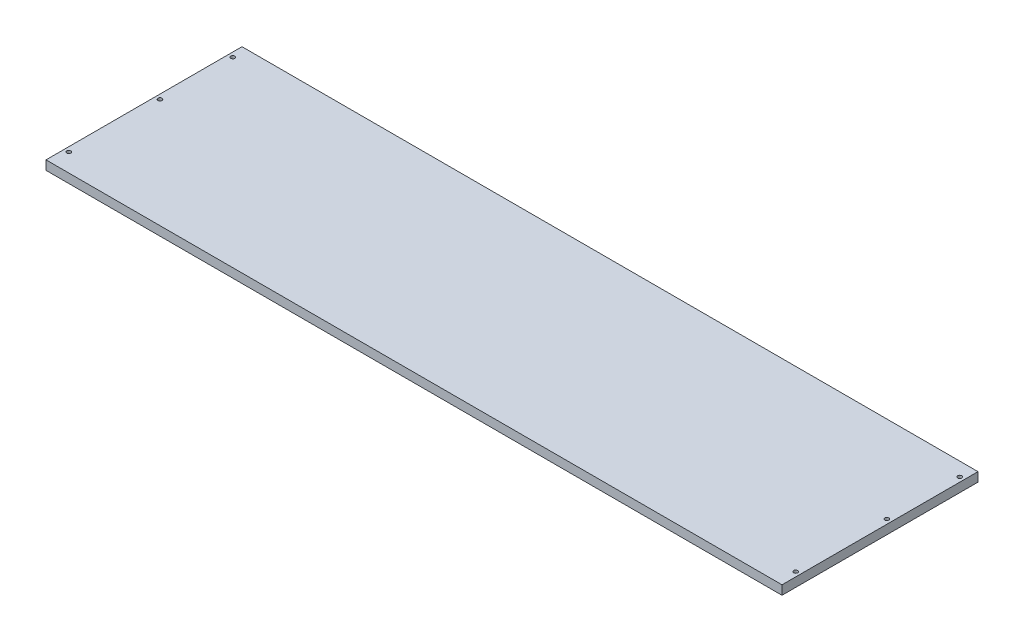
from build123d import *

# Parameters (mm, degrees)
SKETCH1_W      = 1025.398
SKETCH1_H      = 304.8
EXTRUDE1_DEPTH = 12.7
SKETCH2_R      = 2.8067
EXTRUDE2_DEPTH = 1070.815586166
SKETCH3_W      = 1080.18931484
SKETCH3_H      = 62.929948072
EXTRUDE3_DEPTH = 1070.815586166


with BuildPart() as part:
    # Sketch1 → Extrude1 (new body)
    with BuildSketch(Plane(origin=(0, 0, 0), x_dir=(1, 0, 0), z_dir=(0, 1, 0))):
        with Locations((512.699, 152.4)):
            Rectangle(SKETCH1_W, SKETCH1_H)
    extrude(amount=EXTRUDE1_DEPTH)

    # Sketch2 → Extrude2 (cut, through all)
    with BuildSketch(Plane(origin=(0, 12.7, 0), x_dir=(1, 0, 0), z_dir=(0, 1, 0))):
        with Locations(Location((1019.048, 254, 0), (0, 0, 270))):
            Circle(SKETCH2_R)
        with Locations(Location((1019.048, 152.4, 0), (0, 0, 270))):
            Circle(SKETCH2_R)
        with Locations(Location((6.35, 152.4, 0), (0, 0, 90))):
            Circle(SKETCH2_R)
        with Locations(Location((6.35, 254, 0), (0, 0, 90))):
            Circle(SKETCH2_R)
        with Locations(Location((1019.048, 25.4, 0), (0, 0, 90))):
            Circle(SKETCH2_R)
        with Locations(Location((6.35, 25.4, 0), (0, 0, 270))):
            Circle(SKETCH2_R)
    extrude(amount=-EXTRUDE2_DEPTH, mode=Mode.SUBTRACT)

    # Sketch3 → Extrude3 (cut, through all)
    with BuildSketch(Plane(origin=(0, 12.7, 0), x_dir=(1, 0, 0), z_dir=(0, 1, 0))):
        with Locations((511.725856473, 304.514974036)):
            Rectangle(SKETCH3_W, SKETCH3_H)
    extrude(amount=-EXTRUDE3_DEPTH, mode=Mode.SUBTRACT)


solid = part.part
